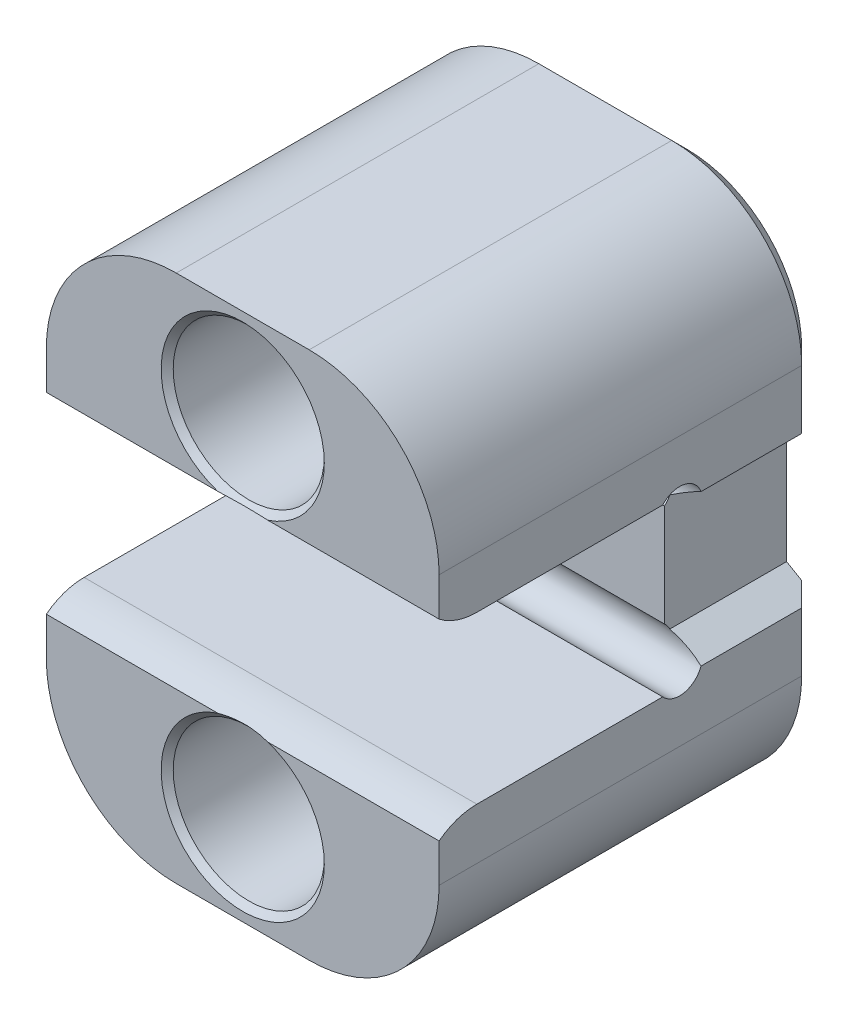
ISO-10303-21;
HEADER;
FILE_DESCRIPTION(('STEP AP214'),'2;1');
FILE_NAME('part.step','',(''),(''),'','','');
FILE_SCHEMA(('AUTOMOTIVE_DESIGN { 1 0 10303 214 1 1 1 1 }'));
ENDSEC;
DATA;
#1=APPLICATION_CONTEXT('core data for automotive mechanical design processes');
#2=APPLICATION_PROTOCOL_DEFINITION('international standard','automotive_design',2000,#1);
#3=PRODUCT_CONTEXT('',#1,'mechanical');
#4=PRODUCT('Part','Part','',(#3));
#5=PRODUCT_RELATED_PRODUCT_CATEGORY('part','',(#4));
#6=PRODUCT_DEFINITION_FORMATION('','',#4);
#7=PRODUCT_DEFINITION_CONTEXT('part definition',#1,'design');
#8=PRODUCT_DEFINITION('design','',#6,#7);
#9=PRODUCT_DEFINITION_SHAPE('','',#8);
#10=(LENGTH_UNIT() NAMED_UNIT(*) SI_UNIT(.MILLI.,.METRE.));
#11=(NAMED_UNIT(*) PLANE_ANGLE_UNIT() SI_UNIT($,.RADIAN.));
#12=(NAMED_UNIT(*) SI_UNIT($,.STERADIAN.) SOLID_ANGLE_UNIT());
#13=UNCERTAINTY_MEASURE_WITH_UNIT(LENGTH_MEASURE(1.E-05),#10,'distance_accuracy_value','');
#14=(GEOMETRIC_REPRESENTATION_CONTEXT(3) GLOBAL_UNCERTAINTY_ASSIGNED_CONTEXT((#13)) GLOBAL_UNIT_ASSIGNED_CONTEXT((#10,
#11,#12)) REPRESENTATION_CONTEXT('',''));
#15=CARTESIAN_POINT('',(0.,0.,0.));
#16=DIRECTION('',(0.,0.,1.));
#17=DIRECTION('',(1.,0.,0.));
#18=AXIS2_PLACEMENT_3D('',#15,#16,#17);
#19=CARTESIAN_POINT('',(13.,17.5,0.));
#20=DIRECTION('',(0.,0.,-1.));
#21=DIRECTION('',(0.,1.,0.));
#22=AXIS2_PLACEMENT_3D('',#19,#20,#21);
#23=PLANE('',#22);
#24=DIRECTION('',(1.,0.,0.));
#25=VECTOR('',#24,1.);
#26=CARTESIAN_POINT('',(-13.,6.35903533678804,0.));
#27=LINE('',#26,#25);
#28=CARTESIAN_POINT('',(-13.,6.35903533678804,0.));
#29=VERTEX_POINT('',#28);
#30=CARTESIAN_POINT('',(-1.65241711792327,6.35903533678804,0.));
#31=VERTEX_POINT('',#30);
#32=EDGE_CURVE('E531',#29,#31,#27,.T.);
#33=ORIENTED_EDGE('',*,*,#32,.T.);
#34=CARTESIAN_POINT('',(0.,11.5,0.));
#35=DIRECTION('',(0.,0.,-1.));
#36=DIRECTION('',(0.,1.,0.));
#37=AXIS2_PLACEMENT_3D('',#34,#35,#36);
#38=CIRCLE('',#37,5.4);
#39=CARTESIAN_POINT('',(1.65241711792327,6.35903533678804,0.));
#40=VERTEX_POINT('',#39);
#41=EDGE_CURVE('E46',#31,#40,#38,.T.);
#42=ORIENTED_EDGE('',*,*,#41,.T.);
#43=CARTESIAN_POINT('',(13.,6.35903533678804,0.));
#44=VERTEX_POINT('',#43);
#45=EDGE_CURVE('E530',#40,#44,#27,.T.);
#46=ORIENTED_EDGE('',*,*,#45,.T.);
#47=DIRECTION('',(0.,-1.,0.));
#48=VECTOR('',#47,1.);
#49=CARTESIAN_POINT('',(13.,17.5,0.));
#50=LINE('',#49,#48);
#51=CARTESIAN_POINT('',(13.,8.9,0.));
#52=VERTEX_POINT('',#51);
#53=EDGE_CURVE('E248',#52,#44,#50,.T.);
#54=ORIENTED_EDGE('',*,*,#53,.F.);
#55=CARTESIAN_POINT('',(4.4,8.9,0.));
#56=DIRECTION('',(0.,0.,-1.));
#57=DIRECTION('',(0.,1.,0.));
#58=AXIS2_PLACEMENT_3D('',#55,#56,#57);
#59=CIRCLE('',#58,8.6);
#60=CARTESIAN_POINT('',(4.4,17.5,0.));
#61=VERTEX_POINT('',#60);
#62=EDGE_CURVE('E278',#52,#61,#59,.F.);
#63=ORIENTED_EDGE('',*,*,#62,.T.);
#64=DIRECTION('',(-1.,0.,0.));
#65=VECTOR('',#64,1.);
#66=CARTESIAN_POINT('',(13.,17.5,0.));
#67=LINE('',#66,#65);
#68=CARTESIAN_POINT('',(-4.39999999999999,17.5,0.));
#69=VERTEX_POINT('',#68);
#70=EDGE_CURVE('E245',#61,#69,#67,.T.);
#71=ORIENTED_EDGE('',*,*,#70,.T.);
#72=CARTESIAN_POINT('',(-4.4,8.9,0.));
#73=DIRECTION('',(0.,0.,-1.));
#74=DIRECTION('',(0.,1.,0.));
#75=AXIS2_PLACEMENT_3D('',#72,#73,#74);
#76=CIRCLE('',#75,8.6);
#77=CARTESIAN_POINT('',(-13.,8.9,0.));
#78=VERTEX_POINT('',#77);
#79=EDGE_CURVE('E276',#69,#78,#76,.F.);
#80=ORIENTED_EDGE('',*,*,#79,.T.);
#81=DIRECTION('',(0.,-1.,0.));
#82=VECTOR('',#81,1.);
#83=CARTESIAN_POINT('',(-13.,17.5,0.));
#84=LINE('',#83,#82);
#85=EDGE_CURVE('E252',#78,#29,#84,.T.);
#86=ORIENTED_EDGE('',*,*,#85,.T.);
#87=EDGE_LOOP('',(#33,#42,#46,#54,#63,#71,#80,#86));
#88=FACE_BOUND('',#87,.T.);
#89=ADVANCED_FACE('F33',(#88),#23,.F.);
#90=CARTESIAN_POINT('',(13.,-5.5,0.));
#91=DIRECTION('',(-1.,0.,0.));
#92=DIRECTION('',(0.,0.,1.));
#93=AXIS2_PLACEMENT_3D('',#90,#91,#92);
#94=PLANE('',#93);
#95=DIRECTION('',(0.,0.,1.));
#96=VECTOR('',#95,1.);
#97=CARTESIAN_POINT('',(13.,5.,-25.));
#98=LINE('',#97,#96);
#99=CARTESIAN_POINT('',(13.,5.,-24.));
#100=VERTEX_POINT('',#99);
#101=CARTESIAN_POINT('',(13.,5.,-17.3342135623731));
#102=VERTEX_POINT('',#101);
#103=EDGE_CURVE('E505',#100,#102,#98,.T.);
#104=ORIENTED_EDGE('',*,*,#103,.F.);
#105=DIRECTION('',(0.,1.,0.));
#106=VECTOR('',#105,1.);
#107=CARTESIAN_POINT('',(13.,-5.5,-24.));
#108=LINE('',#107,#106);
#109=CARTESIAN_POINT('',(13.,8.9,-24.));
#110=VERTEX_POINT('',#109);
#111=EDGE_CURVE('E327',#100,#110,#108,.T.);
#112=ORIENTED_EDGE('',*,*,#111,.T.);
#113=DIRECTION('',(0.,0.,1.));
#114=VECTOR('',#113,1.);
#115=CARTESIAN_POINT('',(13.,8.9,0.));
#116=LINE('',#115,#114);
#117=EDGE_CURVE('E274',#110,#52,#116,.T.);
#118=ORIENTED_EDGE('',*,*,#117,.T.);
#119=ORIENTED_EDGE('',*,*,#53,.T.);
#120=CARTESIAN_POINT('',(13.,9.5673182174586,-2.49999968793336));
#121=DIRECTION('',(-1.,0.,0.));
#122=DIRECTION('',(0.,0.,-1.));
#123=AXIS2_PLACEMENT_3D('',#120,#121,#122);
#124=CIRCLE('',#123,4.06731821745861);
#125=CARTESIAN_POINT('',(13.,5.5,-2.49999999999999));
#126=VERTEX_POINT('',#125);
#127=EDGE_CURVE('E526',#126,#44,#124,.T.);
#128=ORIENTED_EDGE('',*,*,#127,.F.);
#129=DIRECTION('',(0.,0.,-1.));
#130=VECTOR('',#129,1.);
#131=CARTESIAN_POINT('',(13.,5.5,0.));
#132=LINE('',#131,#130);
#133=CARTESIAN_POINT('',(13.,5.5,-14.8019660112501));
#134=VERTEX_POINT('',#133);
#135=EDGE_CURVE('E243',#126,#134,#132,.T.);
#136=ORIENTED_EDGE('',*,*,#135,.T.);
#137=CARTESIAN_POINT('',(13.,4.5,-15.92));
#138=DIRECTION('',(1.,0.,0.));
#139=DIRECTION('',(0.,0.,-1.));
#140=AXIS2_PLACEMENT_3D('',#137,#138,#139);
#141=CIRCLE('',#140,1.5);
#142=EDGE_CURVE('E224',#102,#134,#141,.T.);
#143=ORIENTED_EDGE('',*,*,#142,.F.);
#144=EDGE_LOOP('',(#104,#112,#118,#119,#128,#136,#143));
#145=FACE_BOUND('',#144,.T.);
#146=ADVANCED_FACE('F411',(#145),#94,.F.);
#147=CARTESIAN_POINT('',(13.,5.5,0.));
#148=DIRECTION('',(0.,1.,0.));
#149=DIRECTION('',(0.,0.,1.));
#150=AXIS2_PLACEMENT_3D('',#147,#148,#149);
#151=PLANE('',#150);
#152=DIRECTION('',(0.,0.,-1.));
#153=VECTOR('',#152,1.);
#154=CARTESIAN_POINT('',(-13.,5.5,0.));
#155=LINE('',#154,#153);
#156=CARTESIAN_POINT('',(-13.,5.5,-2.49999999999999));
#157=VERTEX_POINT('',#156);
#158=CARTESIAN_POINT('',(-13.,5.5,-14.8019660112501));
#159=VERTEX_POINT('',#158);
#160=EDGE_CURVE('E255',#157,#159,#155,.T.);
#161=ORIENTED_EDGE('',*,*,#160,.T.);
#162=DIRECTION('',(1.,0.,0.));
#163=VECTOR('',#162,1.);
#164=CARTESIAN_POINT('',(-13.,5.5,-14.8019660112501));
#165=LINE('',#164,#163);
#166=EDGE_CURVE('E536',#159,#134,#165,.T.);
#167=ORIENTED_EDGE('',*,*,#166,.T.);
#168=ORIENTED_EDGE('',*,*,#135,.F.);
#169=DIRECTION('',(1.,0.,0.));
#170=VECTOR('',#169,1.);
#171=CARTESIAN_POINT('',(-13.,5.5,-2.49999999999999));
#172=LINE('',#171,#170);
#173=EDGE_CURVE('E535',#157,#126,#172,.T.);
#174=ORIENTED_EDGE('',*,*,#173,.F.);
#175=EDGE_LOOP('',(#161,#167,#168,#174));
#176=FACE_BOUND('',#175,.T.);
#177=ADVANCED_FACE('F436',(#176),#151,.F.);
#178=CARTESIAN_POINT('',(13.,5.5,-16.92));
#179=DIRECTION('',(0.,0.,-1.));
#180=DIRECTION('',(-1.,0.,0.));
#181=AXIS2_PLACEMENT_3D('',#178,#179,#180);
#182=PLANE('',#181);
#183=DIRECTION('',(0.,-1.,0.));
#184=VECTOR('',#183,1.);
#185=CARTESIAN_POINT('',(-13.,5.5,-16.92));
#186=LINE('',#185,#184);
#187=CARTESIAN_POINT('',(-13.,3.3819660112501,-16.92));
#188=VERTEX_POINT('',#187);
#189=CARTESIAN_POINT('',(-13.,-3.3819660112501,-16.92));
#190=VERTEX_POINT('',#189);
#191=EDGE_CURVE('E259',#188,#190,#186,.T.);
#192=ORIENTED_EDGE('',*,*,#191,.T.);
#193=DIRECTION('',(1.,0.,0.));
#194=VECTOR('',#193,1.);
#195=CARTESIAN_POINT('',(-13.,-3.38196601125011,-16.92));
#196=LINE('',#195,#194);
#197=CARTESIAN_POINT('',(11.,-3.3819660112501,-16.92));
#198=VERTEX_POINT('',#197);
#199=EDGE_CURVE('E225',#190,#198,#196,.T.);
#200=ORIENTED_EDGE('',*,*,#199,.T.);
#201=DIRECTION('',(0.,1.,0.));
#202=VECTOR('',#201,1.);
#203=CARTESIAN_POINT('',(11.,5.5,-16.92));
#204=LINE('',#203,#202);
#205=CARTESIAN_POINT('',(11.,3.3819660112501,-16.92));
#206=VERTEX_POINT('',#205);
#207=EDGE_CURVE('E256',#198,#206,#204,.T.);
#208=ORIENTED_EDGE('',*,*,#207,.T.);
#209=DIRECTION('',(1.,0.,0.));
#210=VECTOR('',#209,1.);
#211=CARTESIAN_POINT('',(-13.,3.38196601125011,-16.92));
#212=LINE('',#211,#210);
#213=EDGE_CURVE('E541',#206,#188,#212,.F.);
#214=ORIENTED_EDGE('',*,*,#213,.T.);
#215=EDGE_LOOP('',(#192,#200,#208,#214));
#216=FACE_BOUND('',#215,.T.);
#217=ADVANCED_FACE('F433',(#216),#182,.F.);
#218=CARTESIAN_POINT('',(13.,-5.5,-16.92));
#219=DIRECTION('',(0.,-1.,0.));
#220=DIRECTION('',(0.,0.,-1.));
#221=AXIS2_PLACEMENT_3D('',#218,#219,#220);
#222=PLANE('',#221);
#223=DIRECTION('',(0.,0.,1.));
#224=VECTOR('',#223,1.);
#225=CARTESIAN_POINT('',(13.,-5.5,-16.92));
#226=LINE('',#225,#224);
#227=CARTESIAN_POINT('',(13.,-5.5,-14.8019660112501));
#228=VERTEX_POINT('',#227);
#229=CARTESIAN_POINT('',(13.,-5.5,-2.49999999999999));
#230=VERTEX_POINT('',#229);
#231=EDGE_CURVE('E231',#228,#230,#226,.T.);
#232=ORIENTED_EDGE('',*,*,#231,.F.);
#233=DIRECTION('',(1.,0.,0.));
#234=VECTOR('',#233,1.);
#235=CARTESIAN_POINT('',(-13.,-5.5,-14.8019660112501));
#236=LINE('',#235,#234);
#237=CARTESIAN_POINT('',(-13.,-5.5,-14.8019660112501));
#238=VERTEX_POINT('',#237);
#239=EDGE_CURVE('E214',#228,#238,#236,.F.);
#240=ORIENTED_EDGE('',*,*,#239,.T.);
#241=DIRECTION('',(0.,0.,1.));
#242=VECTOR('',#241,1.);
#243=CARTESIAN_POINT('',(-13.,-5.5,-16.92));
#244=LINE('',#243,#242);
#245=CARTESIAN_POINT('',(-13.,-5.5,-2.49999999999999));
#246=VERTEX_POINT('',#245);
#247=EDGE_CURVE('E262',#238,#246,#244,.T.);
#248=ORIENTED_EDGE('',*,*,#247,.T.);
#249=DIRECTION('',(1.,0.,0.));
#250=VECTOR('',#249,1.);
#251=CARTESIAN_POINT('',(-13.,-5.5,-2.49999999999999));
#252=LINE('',#251,#250);
#253=EDGE_CURVE('E241',#246,#230,#252,.T.);
#254=ORIENTED_EDGE('',*,*,#253,.T.);
#255=EDGE_LOOP('',(#232,#240,#248,#254));
#256=FACE_BOUND('',#255,.T.);
#257=ADVANCED_FACE('F239',(#256),#222,.F.);
#258=CARTESIAN_POINT('',(13.,-5.5,0.));
#259=DIRECTION('',(0.,0.,-1.));
#260=DIRECTION('',(0.,1.,0.));
#261=AXIS2_PLACEMENT_3D('',#258,#259,#260);
#262=PLANE('',#261);
#263=DIRECTION('',(1.,0.,0.));
#264=VECTOR('',#263,1.);
#265=CARTESIAN_POINT('',(-13.,-6.35903533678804,0.));
#266=LINE('',#265,#264);
#267=CARTESIAN_POINT('',(1.65241711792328,-6.35903533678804,0.));
#268=VERTEX_POINT('',#267);
#269=CARTESIAN_POINT('',(13.,-6.35903533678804,0.));
#270=VERTEX_POINT('',#269);
#271=EDGE_CURVE('E554',#268,#270,#266,.T.);
#272=ORIENTED_EDGE('',*,*,#271,.F.);
#273=CARTESIAN_POINT('',(0.,-11.5,0.));
#274=DIRECTION('',(0.,0.,-1.));
#275=DIRECTION('',(0.,1.,0.));
#276=AXIS2_PLACEMENT_3D('',#273,#274,#275);
#277=CIRCLE('',#276,5.4);
#278=CARTESIAN_POINT('',(-1.65241711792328,-6.35903533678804,0.));
#279=VERTEX_POINT('',#278);
#280=EDGE_CURVE('E373',#268,#279,#277,.T.);
#281=ORIENTED_EDGE('',*,*,#280,.T.);
#282=CARTESIAN_POINT('',(-13.,-6.35903533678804,0.));
#283=VERTEX_POINT('',#282);
#284=EDGE_CURVE('E550',#283,#279,#266,.T.);
#285=ORIENTED_EDGE('',*,*,#284,.F.);
#286=DIRECTION('',(0.,-1.,0.));
#287=VECTOR('',#286,1.);
#288=CARTESIAN_POINT('',(-13.,-5.5,0.));
#289=LINE('',#288,#287);
#290=CARTESIAN_POINT('',(-13.,-8.9,0.));
#291=VERTEX_POINT('',#290);
#292=EDGE_CURVE('E264',#283,#291,#289,.T.);
#293=ORIENTED_EDGE('',*,*,#292,.T.);
#294=CARTESIAN_POINT('',(-4.4,-8.9,0.));
#295=DIRECTION('',(0.,0.,-1.));
#296=DIRECTION('',(0.,1.,0.));
#297=AXIS2_PLACEMENT_3D('',#294,#295,#296);
#298=CIRCLE('',#297,8.6);
#299=CARTESIAN_POINT('',(-4.39999999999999,-17.5,0.));
#300=VERTEX_POINT('',#299);
#301=EDGE_CURVE('E290',#291,#300,#298,.F.);
#302=ORIENTED_EDGE('',*,*,#301,.T.);
#303=DIRECTION('',(-1.,0.,0.));
#304=VECTOR('',#303,1.);
#305=CARTESIAN_POINT('',(13.,-17.5,0.));
#306=LINE('',#305,#304);
#307=CARTESIAN_POINT('',(4.4,-17.5,0.));
#308=VERTEX_POINT('',#307);
#309=EDGE_CURVE('E269',#308,#300,#306,.T.);
#310=ORIENTED_EDGE('',*,*,#309,.F.);
#311=CARTESIAN_POINT('',(4.4,-8.9,0.));
#312=DIRECTION('',(0.,0.,-1.));
#313=DIRECTION('',(0.,1.,0.));
#314=AXIS2_PLACEMENT_3D('',#311,#312,#313);
#315=CIRCLE('',#314,8.6);
#316=CARTESIAN_POINT('',(13.,-8.9,0.));
#317=VERTEX_POINT('',#316);
#318=EDGE_CURVE('E292',#308,#317,#315,.F.);
#319=ORIENTED_EDGE('',*,*,#318,.T.);
#320=DIRECTION('',(0.,-1.,0.));
#321=VECTOR('',#320,1.);
#322=CARTESIAN_POINT('',(13.,-5.5,0.));
#323=LINE('',#322,#321);
#324=EDGE_CURVE('E242',#270,#317,#323,.T.);
#325=ORIENTED_EDGE('',*,*,#324,.F.);
#326=EDGE_LOOP('',(#272,#281,#285,#293,#302,#310,#319,#325));
#327=FACE_BOUND('',#326,.T.);
#328=ADVANCED_FACE('F426',(#327),#262,.F.);
#329=CARTESIAN_POINT('',(13.,-17.5,0.));
#330=DIRECTION('',(0.,1.,0.));
#331=DIRECTION('',(0.,0.,1.));
#332=AXIS2_PLACEMENT_3D('',#329,#330,#331);
#333=PLANE('',#332);
#334=DIRECTION('',(0.,0.,-1.));
#335=VECTOR('',#334,1.);
#336=CARTESIAN_POINT('',(-4.4,-17.5,-25.));
#337=LINE('',#336,#335);
#338=CARTESIAN_POINT('',(-4.4,-17.5,-24.));
#339=VERTEX_POINT('',#338);
#340=EDGE_CURVE('E285',#300,#339,#337,.T.);
#341=ORIENTED_EDGE('',*,*,#340,.T.);
#342=DIRECTION('',(1.,0.,0.));
#343=VECTOR('',#342,1.);
#344=CARTESIAN_POINT('',(13.,-17.5,-24.));
#345=LINE('',#344,#343);
#346=CARTESIAN_POINT('',(4.4,-17.5,-24.));
#347=VERTEX_POINT('',#346);
#348=EDGE_CURVE('E335',#339,#347,#345,.T.);
#349=ORIENTED_EDGE('',*,*,#348,.T.);
#350=DIRECTION('',(0.,0.,-1.));
#351=VECTOR('',#350,1.);
#352=CARTESIAN_POINT('',(4.4,-17.5,0.));
#353=LINE('',#352,#351);
#354=EDGE_CURVE('E288',#347,#308,#353,.F.);
#355=ORIENTED_EDGE('',*,*,#354,.T.);
#356=ORIENTED_EDGE('',*,*,#309,.T.);
#357=EDGE_LOOP('',(#341,#349,#355,#356));
#358=FACE_BOUND('',#357,.T.);
#359=ADVANCED_FACE('F422',(#358),#333,.F.);
#360=CARTESIAN_POINT('',(13.,17.5,-25.));
#361=DIRECTION('',(0.,0.,1.));
#362=DIRECTION('',(1.,0.,0.));
#363=AXIS2_PLACEMENT_3D('',#360,#361,#362);
#364=PLANE('',#363);
#365=DIRECTION('',(0.866025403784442,-0.499999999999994,0.));
#366=VECTOR('',#365,1.);
#367=CARTESIAN_POINT('',(11.,-3.84529946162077,-25.));
#368=LINE('',#367,#366);
#369=CARTESIAN_POINT('',(11.,-3.84529946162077,-25.));
#370=VERTEX_POINT('',#369);
#371=CARTESIAN_POINT('',(12.,-4.42264973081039,-25.));
#372=VERTEX_POINT('',#371);
#373=EDGE_CURVE('E558',#370,#372,#368,.T.);
#374=ORIENTED_EDGE('',*,*,#373,.T.);
#375=DIRECTION('',(0.,-1.,0.));
#376=VECTOR('',#375,1.);
#377=CARTESIAN_POINT('',(12.,17.5,-25.));
#378=LINE('',#377,#376);
#379=CARTESIAN_POINT('',(12.,-8.9,-25.));
#380=VERTEX_POINT('',#379);
#381=EDGE_CURVE('E325',#372,#380,#378,.T.);
#382=ORIENTED_EDGE('',*,*,#381,.T.);
#383=CARTESIAN_POINT('',(4.4,-8.9,-25.));
#384=DIRECTION('',(0.,0.,1.));
#385=DIRECTION('',(1.,0.,0.));
#386=AXIS2_PLACEMENT_3D('',#383,#384,#385);
#387=CIRCLE('',#386,7.6);
#388=CARTESIAN_POINT('',(4.4,-16.5,-25.));
#389=VERTEX_POINT('',#388);
#390=EDGE_CURVE('E321',#380,#389,#387,.F.);
#391=ORIENTED_EDGE('',*,*,#390,.T.);
#392=DIRECTION('',(-1.,0.,0.));
#393=VECTOR('',#392,1.);
#394=CARTESIAN_POINT('',(13.,-16.5,-25.));
#395=LINE('',#394,#393);
#396=CARTESIAN_POINT('',(-4.4,-16.5,-25.));
#397=VERTEX_POINT('',#396);
#398=EDGE_CURVE('E317',#389,#397,#395,.T.);
#399=ORIENTED_EDGE('',*,*,#398,.T.);
#400=CARTESIAN_POINT('',(-4.4,-8.9,-25.));
#401=DIRECTION('',(0.,0.,1.));
#402=DIRECTION('',(1.,0.,0.));
#403=AXIS2_PLACEMENT_3D('',#400,#401,#402);
#404=CIRCLE('',#403,7.6);
#405=CARTESIAN_POINT('',(-12.,-8.9,-25.));
#406=VERTEX_POINT('',#405);
#407=EDGE_CURVE('E315',#397,#406,#404,.F.);
#408=ORIENTED_EDGE('',*,*,#407,.T.);
#409=DIRECTION('',(0.,1.,0.));
#410=VECTOR('',#409,1.);
#411=CARTESIAN_POINT('',(-12.,8.9,-25.));
#412=LINE('',#411,#410);
#413=CARTESIAN_POINT('',(-12.,8.9,-25.));
#414=VERTEX_POINT('',#413);
#415=EDGE_CURVE('E311',#406,#414,#412,.T.);
#416=ORIENTED_EDGE('',*,*,#415,.T.);
#417=CARTESIAN_POINT('',(-4.4,8.9,-25.));
#418=DIRECTION('',(0.,0.,1.));
#419=DIRECTION('',(1.,0.,0.));
#420=AXIS2_PLACEMENT_3D('',#417,#418,#419);
#421=CIRCLE('',#420,7.6);
#422=CARTESIAN_POINT('',(-4.4,16.5,-25.));
#423=VERTEX_POINT('',#422);
#424=EDGE_CURVE('E309',#414,#423,#421,.F.);
#425=ORIENTED_EDGE('',*,*,#424,.T.);
#426=DIRECTION('',(1.,0.,0.));
#427=VECTOR('',#426,1.);
#428=CARTESIAN_POINT('',(13.,16.5,-25.));
#429=LINE('',#428,#427);
#430=CARTESIAN_POINT('',(4.4,16.5,-25.));
#431=VERTEX_POINT('',#430);
#432=EDGE_CURVE('E313',#423,#431,#429,.T.);
#433=ORIENTED_EDGE('',*,*,#432,.T.);
#434=CARTESIAN_POINT('',(4.4,8.9,-25.));
#435=DIRECTION('',(0.,0.,1.));
#436=DIRECTION('',(1.,0.,0.));
#437=AXIS2_PLACEMENT_3D('',#434,#435,#436);
#438=CIRCLE('',#437,7.6);
#439=CARTESIAN_POINT('',(12.,8.9,-25.));
#440=VERTEX_POINT('',#439);
#441=EDGE_CURVE('E319',#431,#440,#438,.F.);
#442=ORIENTED_EDGE('',*,*,#441,.T.);
#443=DIRECTION('',(0.,-1.,0.));
#444=VECTOR('',#443,1.);
#445=CARTESIAN_POINT('',(12.,17.5,-25.));
#446=LINE('',#445,#444);
#447=CARTESIAN_POINT('',(12.,4.42264973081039,-25.));
#448=VERTEX_POINT('',#447);
#449=EDGE_CURVE('E323',#440,#448,#446,.T.);
#450=ORIENTED_EDGE('',*,*,#449,.T.);
#451=DIRECTION('',(-0.866025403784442,-0.499999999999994,0.));
#452=VECTOR('',#451,1.);
#453=CARTESIAN_POINT('',(11.,3.84529946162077,-25.));
#454=LINE('',#453,#452);
#455=CARTESIAN_POINT('',(11.,3.84529946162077,-25.));
#456=VERTEX_POINT('',#455);
#457=EDGE_CURVE('E508',#448,#456,#454,.T.);
#458=ORIENTED_EDGE('',*,*,#457,.T.);
#459=DIRECTION('',(0.,-1.,0.));
#460=VECTOR('',#459,1.);
#461=CARTESIAN_POINT('',(11.,-3.84529946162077,-25.));
#462=LINE('',#461,#460);
#463=EDGE_CURVE('E553',#456,#370,#462,.T.);
#464=ORIENTED_EDGE('',*,*,#463,.T.);
#465=EDGE_LOOP('',(#374,#382,#391,#399,#408,#416,#425,#433,#442,#450,#458,#464));
#466=FACE_BOUND('',#465,.T.);
#467=CARTESIAN_POINT('',(0.,11.5,-25.));
#468=DIRECTION('',(0.,0.,1.));
#469=DIRECTION('',(1.,0.,0.));
#470=AXIS2_PLACEMENT_3D('',#467,#468,#469);
#471=CIRCLE('',#470,2.89999999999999);
#472=CARTESIAN_POINT('',(2.89999999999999,11.5,-25.));
#473=VERTEX_POINT('',#472);
#474=EDGE_CURVE('E621',#473,#473,#471,.T.);
#475=ORIENTED_EDGE('',*,*,#474,.T.);
#476=EDGE_LOOP('',(#475));
#477=FACE_BOUND('',#476,.T.);
#478=CARTESIAN_POINT('',(0.,-11.5,-25.));
#479=DIRECTION('',(0.,0.,1.));
#480=DIRECTION('',(1.,0.,0.));
#481=AXIS2_PLACEMENT_3D('',#478,#479,#480);
#482=CIRCLE('',#481,2.89999999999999);
#483=CARTESIAN_POINT('',(2.89999999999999,-11.5,-25.));
#484=VERTEX_POINT('',#483);
#485=EDGE_CURVE('E236',#484,#484,#482,.T.);
#486=ORIENTED_EDGE('',*,*,#485,.T.);
#487=EDGE_LOOP('',(#486));
#488=FACE_BOUND('',#487,.T.);
#489=ADVANCED_FACE('F418',(#466,#477,#488),#364,.F.);
#490=CARTESIAN_POINT('',(13.,17.5,0.));
#491=DIRECTION('',(0.,-1.,0.));
#492=DIRECTION('',(0.,0.,-1.));
#493=AXIS2_PLACEMENT_3D('',#490,#491,#492);
#494=PLANE('',#493);
#495=DIRECTION('',(0.,0.,1.));
#496=VECTOR('',#495,1.);
#497=CARTESIAN_POINT('',(4.4,17.5,0.));
#498=LINE('',#497,#496);
#499=CARTESIAN_POINT('',(4.4,17.5,-24.));
#500=VERTEX_POINT('',#499);
#501=EDGE_CURVE('E282',#61,#500,#498,.F.);
#502=ORIENTED_EDGE('',*,*,#501,.T.);
#503=DIRECTION('',(-1.,0.,0.));
#504=VECTOR('',#503,1.);
#505=CARTESIAN_POINT('',(13.,17.5,-24.));
#506=LINE('',#505,#504);
#507=CARTESIAN_POINT('',(-4.4,17.5,-24.));
#508=VERTEX_POINT('',#507);
#509=EDGE_CURVE('E339',#500,#508,#506,.T.);
#510=ORIENTED_EDGE('',*,*,#509,.T.);
#511=DIRECTION('',(0.,0.,1.));
#512=VECTOR('',#511,1.);
#513=CARTESIAN_POINT('',(-4.4,17.5,0.));
#514=LINE('',#513,#512);
#515=EDGE_CURVE('E280',#508,#69,#514,.T.);
#516=ORIENTED_EDGE('',*,*,#515,.T.);
#517=ORIENTED_EDGE('',*,*,#70,.F.);
#518=EDGE_LOOP('',(#502,#510,#516,#517));
#519=FACE_BOUND('',#518,.T.);
#520=ADVANCED_FACE('F410',(#519),#494,.F.);
#521=DIRECTION('',(0.,0.,-1.));
#522=VECTOR('',#521,1.);
#523=CARTESIAN_POINT('',(13.,-8.9,0.));
#524=LINE('',#523,#522);
#525=CARTESIAN_POINT('',(13.,-8.9,-24.));
#526=VERTEX_POINT('',#525);
#527=EDGE_CURVE('E272',#317,#526,#524,.T.);
#528=ORIENTED_EDGE('',*,*,#527,.T.);
#529=DIRECTION('',(0.,1.,0.));
#530=VECTOR('',#529,1.);
#531=CARTESIAN_POINT('',(13.,-5.5,-24.));
#532=LINE('',#531,#530);
#533=CARTESIAN_POINT('',(13.,-5.,-24.));
#534=VERTEX_POINT('',#533);
#535=EDGE_CURVE('E305',#526,#534,#532,.T.);
#536=ORIENTED_EDGE('',*,*,#535,.T.);
#537=DIRECTION('',(0.,0.,1.));
#538=VECTOR('',#537,1.);
#539=CARTESIAN_POINT('',(13.,-5.,-25.));
#540=LINE('',#539,#538);
#541=CARTESIAN_POINT('',(13.,-5.,-17.3342135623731));
#542=VERTEX_POINT('',#541);
#543=EDGE_CURVE('E235',#534,#542,#540,.T.);
#544=ORIENTED_EDGE('',*,*,#543,.T.);
#545=CARTESIAN_POINT('',(13.,-4.5,-15.92));
#546=DIRECTION('',(1.,0.,0.));
#547=DIRECTION('',(0.,0.,1.));
#548=AXIS2_PLACEMENT_3D('',#545,#546,#547);
#549=CIRCLE('',#548,1.5);
#550=EDGE_CURVE('E217',#228,#542,#549,.T.);
#551=ORIENTED_EDGE('',*,*,#550,.F.);
#552=ORIENTED_EDGE('',*,*,#231,.T.);
#553=CARTESIAN_POINT('',(13.,-9.5673182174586,-2.49999968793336));
#554=DIRECTION('',(-1.,0.,0.));
#555=DIRECTION('',(0.,0.,1.));
#556=AXIS2_PLACEMENT_3D('',#553,#554,#555);
#557=CIRCLE('',#556,4.06731821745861);
#558=EDGE_CURVE('E544',#270,#230,#557,.T.);
#559=ORIENTED_EDGE('',*,*,#558,.F.);
#560=ORIENTED_EDGE('',*,*,#324,.T.);
#561=EDGE_LOOP('',(#528,#536,#544,#551,#552,#559,#560));
#562=FACE_BOUND('',#561,.T.);
#563=ADVANCED_FACE('F229',(#562),#94,.F.);
#564=CARTESIAN_POINT('',(-13.,-5.5,0.));
#565=DIRECTION('',(-1.,0.,0.));
#566=DIRECTION('',(0.,0.,1.));
#567=AXIS2_PLACEMENT_3D('',#564,#565,#566);
#568=PLANE('',#567);
#569=DIRECTION('',(0.,0.,1.));
#570=VECTOR('',#569,1.);
#571=CARTESIAN_POINT('',(-13.,8.9,-25.));
#572=LINE('',#571,#570);
#573=CARTESIAN_POINT('',(-13.,8.9,-24.));
#574=VERTEX_POINT('',#573);
#575=EDGE_CURVE('E295',#78,#574,#572,.F.);
#576=ORIENTED_EDGE('',*,*,#575,.T.);
#577=DIRECTION('',(0.,-1.,0.));
#578=VECTOR('',#577,1.);
#579=CARTESIAN_POINT('',(-13.,-8.90000000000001,-24.));
#580=LINE('',#579,#578);
#581=CARTESIAN_POINT('',(-13.,-8.9,-24.));
#582=VERTEX_POINT('',#581);
#583=EDGE_CURVE('E341',#574,#582,#580,.T.);
#584=ORIENTED_EDGE('',*,*,#583,.T.);
#585=DIRECTION('',(0.,0.,-1.));
#586=VECTOR('',#585,1.);
#587=CARTESIAN_POINT('',(-13.,-8.9,0.));
#588=LINE('',#587,#586);
#589=EDGE_CURVE('E298',#582,#291,#588,.F.);
#590=ORIENTED_EDGE('',*,*,#589,.T.);
#591=ORIENTED_EDGE('',*,*,#292,.F.);
#592=CARTESIAN_POINT('',(-13.,-9.5673182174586,-2.49999968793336));
#593=DIRECTION('',(-1.,0.,0.));
#594=DIRECTION('',(0.,0.,1.));
#595=AXIS2_PLACEMENT_3D('',#592,#593,#594);
#596=CIRCLE('',#595,4.06731821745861);
#597=EDGE_CURVE('E546',#283,#246,#596,.T.);
#598=ORIENTED_EDGE('',*,*,#597,.T.);
#599=ORIENTED_EDGE('',*,*,#247,.F.);
#600=CARTESIAN_POINT('',(-13.,-4.5,-15.92));
#601=DIRECTION('',(1.,0.,0.));
#602=DIRECTION('',(0.,0.,1.));
#603=AXIS2_PLACEMENT_3D('',#600,#601,#602);
#604=CIRCLE('',#603,1.5);
#605=EDGE_CURVE('E220',#238,#190,#604,.T.);
#606=ORIENTED_EDGE('',*,*,#605,.T.);
#607=ORIENTED_EDGE('',*,*,#191,.F.);
#608=CARTESIAN_POINT('',(-13.,4.5,-15.92));
#609=DIRECTION('',(1.,0.,0.));
#610=DIRECTION('',(0.,0.,-1.));
#611=AXIS2_PLACEMENT_3D('',#608,#609,#610);
#612=CIRCLE('',#611,1.5);
#613=EDGE_CURVE('E600',#188,#159,#612,.T.);
#614=ORIENTED_EDGE('',*,*,#613,.T.);
#615=ORIENTED_EDGE('',*,*,#160,.F.);
#616=CARTESIAN_POINT('',(-13.,9.5673182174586,-2.49999968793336));
#617=DIRECTION('',(-1.,0.,0.));
#618=DIRECTION('',(0.,0.,-1.));
#619=AXIS2_PLACEMENT_3D('',#616,#617,#618);
#620=CIRCLE('',#619,4.06731821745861);
#621=EDGE_CURVE('E532',#157,#29,#620,.T.);
#622=ORIENTED_EDGE('',*,*,#621,.T.);
#623=ORIENTED_EDGE('',*,*,#85,.F.);
#624=EDGE_LOOP('',(#576,#584,#590,#591,#598,#599,#606,#607,#614,#615,#622,#623));
#625=FACE_BOUND('',#624,.T.);
#626=ADVANCED_FACE('F409',(#625),#568,.T.);
#627=CARTESIAN_POINT('',(4.4,8.9,0.));
#628=DIRECTION('',(0.,0.,1.));
#629=DIRECTION('',(1.,0.,0.));
#630=AXIS2_PLACEMENT_3D('',#627,#628,#629);
#631=CYLINDRICAL_SURFACE('',#630,8.6);
#632=ORIENTED_EDGE('',*,*,#117,.F.);
#633=CARTESIAN_POINT('',(4.4,8.9,-24.));
#634=DIRECTION('',(0.,0.,1.));
#635=DIRECTION('',(1.,0.,0.));
#636=AXIS2_PLACEMENT_3D('',#633,#634,#635);
#637=CIRCLE('',#636,8.6);
#638=EDGE_CURVE('E333',#110,#500,#637,.T.);
#639=ORIENTED_EDGE('',*,*,#638,.T.);
#640=ORIENTED_EDGE('',*,*,#501,.F.);
#641=ORIENTED_EDGE('',*,*,#62,.F.);
#642=EDGE_LOOP('',(#632,#639,#640,#641));
#643=FACE_BOUND('',#642,.T.);
#644=ADVANCED_FACE('F414',(#643),#631,.T.);
#645=CARTESIAN_POINT('',(4.4,-8.9,0.));
#646=DIRECTION('',(0.,0.,-1.));
#647=DIRECTION('',(-1.,0.,0.));
#648=AXIS2_PLACEMENT_3D('',#645,#646,#647);
#649=CYLINDRICAL_SURFACE('',#648,8.6);
#650=ORIENTED_EDGE('',*,*,#354,.F.);
#651=CARTESIAN_POINT('',(4.4,-8.9,-24.));
#652=DIRECTION('',(0.,0.,1.));
#653=DIRECTION('',(1.,0.,0.));
#654=AXIS2_PLACEMENT_3D('',#651,#652,#653);
#655=CIRCLE('',#654,8.6);
#656=EDGE_CURVE('E331',#347,#526,#655,.T.);
#657=ORIENTED_EDGE('',*,*,#656,.T.);
#658=ORIENTED_EDGE('',*,*,#527,.F.);
#659=ORIENTED_EDGE('',*,*,#318,.F.);
#660=EDGE_LOOP('',(#650,#657,#658,#659));
#661=FACE_BOUND('',#660,.T.);
#662=ADVANCED_FACE('F446',(#661),#649,.T.);
#663=CARTESIAN_POINT('',(-4.4,-8.9,0.));
#664=DIRECTION('',(0.,0.,1.));
#665=DIRECTION('',(1.,0.,0.));
#666=AXIS2_PLACEMENT_3D('',#663,#664,#665);
#667=CYLINDRICAL_SURFACE('',#666,8.6);
#668=ORIENTED_EDGE('',*,*,#589,.F.);
#669=CARTESIAN_POINT('',(-4.4,-8.9,-24.));
#670=DIRECTION('',(0.,0.,1.));
#671=DIRECTION('',(1.,0.,0.));
#672=AXIS2_PLACEMENT_3D('',#669,#670,#671);
#673=CIRCLE('',#672,8.6);
#674=EDGE_CURVE('E337',#582,#339,#673,.T.);
#675=ORIENTED_EDGE('',*,*,#674,.T.);
#676=ORIENTED_EDGE('',*,*,#340,.F.);
#677=ORIENTED_EDGE('',*,*,#301,.F.);
#678=EDGE_LOOP('',(#668,#675,#676,#677));
#679=FACE_BOUND('',#678,.T.);
#680=ADVANCED_FACE('F450',(#679),#667,.T.);
#681=CARTESIAN_POINT('',(-4.4,8.9,0.));
#682=DIRECTION('',(0.,0.,-1.));
#683=DIRECTION('',(-1.,0.,0.));
#684=AXIS2_PLACEMENT_3D('',#681,#682,#683);
#685=CYLINDRICAL_SURFACE('',#684,8.6);
#686=ORIENTED_EDGE('',*,*,#515,.F.);
#687=CARTESIAN_POINT('',(-4.4,8.9,-24.));
#688=DIRECTION('',(0.,0.,1.));
#689=DIRECTION('',(1.,0.,0.));
#690=AXIS2_PLACEMENT_3D('',#687,#688,#689);
#691=CIRCLE('',#690,8.6);
#692=EDGE_CURVE('E343',#508,#574,#691,.T.);
#693=ORIENTED_EDGE('',*,*,#692,.T.);
#694=ORIENTED_EDGE('',*,*,#575,.F.);
#695=ORIENTED_EDGE('',*,*,#79,.F.);
#696=EDGE_LOOP('',(#686,#693,#694,#695));
#697=FACE_BOUND('',#696,.T.);
#698=ADVANCED_FACE('F405',(#697),#685,.T.);
#699=CARTESIAN_POINT('',(11.,-3.84529946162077,-25.));
#700=DIRECTION('',(-1.,0.,0.));
#701=DIRECTION('',(0.,0.,1.));
#702=AXIS2_PLACEMENT_3D('',#699,#700,#701);
#703=PLANE('',#702);
#704=ORIENTED_EDGE('',*,*,#207,.F.);
#705=CARTESIAN_POINT('',(11.,-4.5,-15.92));
#706=DIRECTION('',(-1.,0.,0.));
#707=DIRECTION('',(0.,0.,1.));
#708=AXIS2_PLACEMENT_3D('',#705,#706,#707);
#709=CIRCLE('',#708,1.5);
#710=CARTESIAN_POINT('',(11.,-3.84529946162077,-17.2695803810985));
#711=VERTEX_POINT('',#710);
#712=EDGE_CURVE('E566',#198,#711,#709,.T.);
#713=ORIENTED_EDGE('',*,*,#712,.T.);
#714=DIRECTION('',(0.,0.,1.));
#715=VECTOR('',#714,1.);
#716=CARTESIAN_POINT('',(11.,-3.84529946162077,-25.));
#717=LINE('',#716,#715);
#718=EDGE_CURVE('E516',#370,#711,#717,.T.);
#719=ORIENTED_EDGE('',*,*,#718,.F.);
#720=ORIENTED_EDGE('',*,*,#463,.F.);
#721=DIRECTION('',(0.,0.,1.));
#722=VECTOR('',#721,1.);
#723=CARTESIAN_POINT('',(11.,3.84529946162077,-25.));
#724=LINE('',#723,#722);
#725=CARTESIAN_POINT('',(11.,3.84529946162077,-17.2695803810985));
#726=VERTEX_POINT('',#725);
#727=EDGE_CURVE('E512',#456,#726,#724,.T.);
#728=ORIENTED_EDGE('',*,*,#727,.T.);
#729=CARTESIAN_POINT('',(11.,4.5,-15.92));
#730=DIRECTION('',(-1.,0.,0.));
#731=DIRECTION('',(0.,0.,1.));
#732=AXIS2_PLACEMENT_3D('',#729,#730,#731);
#733=CIRCLE('',#732,1.5);
#734=EDGE_CURVE('E603',#726,#206,#733,.T.);
#735=ORIENTED_EDGE('',*,*,#734,.T.);
#736=EDGE_LOOP('',(#704,#713,#719,#720,#728,#735));
#737=FACE_BOUND('',#736,.T.);
#738=ADVANCED_FACE('F398',(#737),#703,.F.);
#739=CARTESIAN_POINT('',(11.,3.84529946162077,-25.));
#740=DIRECTION('',(-0.499999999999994,0.866025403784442,0.));
#741=DIRECTION('',(-0.866025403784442,-0.499999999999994,0.));
#742=AXIS2_PLACEMENT_3D('',#739,#740,#741);
#743=PLANE('',#742);
#744=ORIENTED_EDGE('',*,*,#457,.F.);
#745=DIRECTION('',(-0.654653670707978,-0.377964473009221,-0.65465367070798));
#746=VECTOR('',#745,1.);
#747=CARTESIAN_POINT('',(10.4019237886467,3.50000000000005,-26.5980762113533));
#748=LINE('',#747,#746);
#749=EDGE_CURVE('E329',#448,#100,#748,.F.);
#750=ORIENTED_EDGE('',*,*,#749,.T.);
#751=ORIENTED_EDGE('',*,*,#103,.T.);
#752=CARTESIAN_POINT('',(12.1339745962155,4.5,-15.92));
#753=DIRECTION('',(-0.499999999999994,0.866025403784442,0.));
#754=DIRECTION('',(0.866025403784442,0.499999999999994,0.));
#755=AXIS2_PLACEMENT_3D('',#752,#753,#754);
#756=ELLIPSE('',#755,3.00000000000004,1.5);
#757=EDGE_CURVE('E300',#102,#726,#756,.T.);
#758=ORIENTED_EDGE('',*,*,#757,.T.);
#759=ORIENTED_EDGE('',*,*,#727,.F.);
#760=EDGE_LOOP('',(#744,#750,#751,#758,#759));
#761=FACE_BOUND('',#760,.T.);
#762=ADVANCED_FACE('F395',(#761),#743,.F.);
#763=CARTESIAN_POINT('',(11.,-3.84529946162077,-25.));
#764=DIRECTION('',(-0.499999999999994,-0.866025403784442,0.));
#765=DIRECTION('',(0.866025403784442,-0.499999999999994,0.));
#766=AXIS2_PLACEMENT_3D('',#763,#764,#765);
#767=PLANE('',#766);
#768=ORIENTED_EDGE('',*,*,#543,.F.);
#769=DIRECTION('',(0.654653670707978,-0.377964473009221,0.65465367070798));
#770=VECTOR('',#769,1.);
#771=CARTESIAN_POINT('',(13.1237179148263,-5.07142857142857,-23.8762820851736));
#772=LINE('',#771,#770);
#773=EDGE_CURVE('E307',#534,#372,#772,.F.);
#774=ORIENTED_EDGE('',*,*,#773,.T.);
#775=ORIENTED_EDGE('',*,*,#373,.F.);
#776=ORIENTED_EDGE('',*,*,#718,.T.);
#777=CARTESIAN_POINT('',(12.1339745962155,-4.5,-15.92));
#778=DIRECTION('',(-0.499999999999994,-0.866025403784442,0.));
#779=DIRECTION('',(0.866025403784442,-0.499999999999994,0.));
#780=AXIS2_PLACEMENT_3D('',#777,#778,#779);
#781=ELLIPSE('',#780,3.00000000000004,1.5);
#782=EDGE_CURVE('E303',#711,#542,#781,.T.);
#783=ORIENTED_EDGE('',*,*,#782,.T.);
#784=EDGE_LOOP('',(#768,#774,#775,#776,#783));
#785=FACE_BOUND('',#784,.T.);
#786=ADVANCED_FACE('F391',(#785),#767,.F.);
#787=CARTESIAN_POINT('',(-13.,-9.5673182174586,-2.49999968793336));
#788=DIRECTION('',(1.,0.,0.));
#789=DIRECTION('',(0.,0.,-1.));
#790=AXIS2_PLACEMENT_3D('',#787,#788,#789);
#791=CYLINDRICAL_SURFACE('',#790,4.06731821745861);
#792=ORIENTED_EDGE('',*,*,#284,.T.);
#793=CARTESIAN_POINT('',(-1.6524171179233,-6.35903533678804,0.));
#794=CARTESIAN_POINT('',(-1.54697610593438,-6.34460293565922,-0.0185305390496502));
#795=CARTESIAN_POINT('',(-1.44106157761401,-6.33161519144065,-0.0355200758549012));
#796=CARTESIAN_POINT('',(-1.22843065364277,-6.30848807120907,-0.0661786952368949));
#797=CARTESIAN_POINT('',(-1.12171415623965,-6.29834906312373,-0.079847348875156));
#798=CARTESIAN_POINT('',(-0.907595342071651,-6.28087757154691,-0.103627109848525));
#799=CARTESIAN_POINT('',(-0.800192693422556,-6.27354657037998,-0.113736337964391));
#800=CARTESIAN_POINT('',(-0.584958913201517,-6.26167459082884,-0.130211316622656));
#801=CARTESIAN_POINT('',(-0.477127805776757,-6.25713345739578,-0.136577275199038));
#802=CARTESIAN_POINT('',(-0.157266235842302,-6.24778540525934,-0.149695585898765));
#803=CARTESIAN_POINT('',(0.0551455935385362,-6.24693084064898,-0.150920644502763));
#804=CARTESIAN_POINT('',(0.479155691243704,-6.25588996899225,-0.138311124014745));
#805=CARTESIAN_POINT('',(0.690754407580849,-6.26569654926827,-0.124486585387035));
#806=CARTESIAN_POINT('',(0.964106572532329,-6.28543174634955,-0.0974280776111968));
#807=CARTESIAN_POINT('',(1.02691775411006,-6.29045547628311,-0.0905740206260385));
#808=CARTESIAN_POINT('',(1.15230473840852,-6.30147291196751,-0.0756606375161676));
#809=CARTESIAN_POINT('',(1.21488057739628,-6.30746646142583,-0.067601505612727));
#810=CARTESIAN_POINT('',(1.34012223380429,-6.32046771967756,-0.0502737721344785));
#811=CARTESIAN_POINT('',(1.40278655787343,-6.32748097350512,-0.0409985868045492));
#812=CARTESIAN_POINT('',(1.52782730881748,-6.34250653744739,-0.0213268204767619));
#813=CARTESIAN_POINT('',(1.59020369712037,-6.35051897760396,-0.0109300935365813));
#814=CARTESIAN_POINT('',(1.6524171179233,-6.35903533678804,0.));
#815=B_SPLINE_CURVE_WITH_KNOTS('',3,(#793,#794,#795,#796,#797,#798,#799,#800,#801,#802,#803,
#804,#805,#806,#807,#808,#809,#810,#811,#812,#813,#814),.UNSPECIFIED.,.F.,.F.,(4,2,2,2,2,2,2,2,
2,2,4),(0.,0.324061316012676,0.648164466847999,0.972438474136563,1.29669445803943,
1.93309418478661,2.56906959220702,2.7592090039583,2.94931780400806,3.14050199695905,
3.33171109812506),.UNSPECIFIED.);
#816=EDGE_CURVE('E376',#279,#268,#815,.T.);
#817=ORIENTED_EDGE('',*,*,#816,.T.);
#818=ORIENTED_EDGE('',*,*,#271,.T.);
#819=ORIENTED_EDGE('',*,*,#558,.T.);
#820=ORIENTED_EDGE('',*,*,#253,.F.);
#821=ORIENTED_EDGE('',*,*,#597,.F.);
#822=EDGE_LOOP('',(#792,#817,#818,#819,#820,#821));
#823=FACE_BOUND('',#822,.T.);
#824=ADVANCED_FACE('F386',(#823),#791,.T.);
#825=CARTESIAN_POINT('',(-13.,9.5673182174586,-2.49999968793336));
#826=DIRECTION('',(1.,0.,0.));
#827=DIRECTION('',(0.,0.,-1.));
#828=AXIS2_PLACEMENT_3D('',#825,#826,#827);
#829=CYLINDRICAL_SURFACE('',#828,4.06731821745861);
#830=ORIENTED_EDGE('',*,*,#45,.F.);
#831=CARTESIAN_POINT('',(1.6524171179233,6.35903533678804,0.));
#832=CARTESIAN_POINT('',(1.54697610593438,6.34460293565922,-0.0185305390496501));
#833=CARTESIAN_POINT('',(1.44106157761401,6.33161519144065,-0.0355200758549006));
#834=CARTESIAN_POINT('',(1.22843065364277,6.30848807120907,-0.0661786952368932));
#835=CARTESIAN_POINT('',(1.12171415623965,6.29834906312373,-0.0798473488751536));
#836=CARTESIAN_POINT('',(0.907595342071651,6.28087757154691,-0.103627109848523));
#837=CARTESIAN_POINT('',(0.800192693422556,6.27354657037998,-0.113736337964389));
#838=CARTESIAN_POINT('',(0.584958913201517,6.26167459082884,-0.130211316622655));
#839=CARTESIAN_POINT('',(0.477127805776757,6.25713345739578,-0.136577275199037));
#840=CARTESIAN_POINT('',(0.157266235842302,6.24778540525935,-0.149695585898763));
#841=CARTESIAN_POINT('',(-0.0551455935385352,6.24693084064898,-0.150920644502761));
#842=CARTESIAN_POINT('',(-0.479155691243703,6.25588996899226,-0.138311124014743));
#843=CARTESIAN_POINT('',(-0.690754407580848,6.26569654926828,-0.124486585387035));
#844=CARTESIAN_POINT('',(-0.964106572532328,6.28543174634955,-0.0974280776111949));
#845=CARTESIAN_POINT('',(-1.02691775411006,6.29045547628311,-0.0905740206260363));
#846=CARTESIAN_POINT('',(-1.15230473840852,6.30147291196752,-0.0756606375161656));
#847=CARTESIAN_POINT('',(-1.21488057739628,6.30746646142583,-0.0676015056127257));
#848=CARTESIAN_POINT('',(-1.34012223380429,6.32046771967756,-0.0502737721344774));
#849=CARTESIAN_POINT('',(-1.40278655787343,6.32748097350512,-0.0409985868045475));
#850=CARTESIAN_POINT('',(-1.52782730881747,6.34250653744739,-0.0213268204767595));
#851=CARTESIAN_POINT('',(-1.59020369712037,6.35051897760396,-0.0109300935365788));
#852=CARTESIAN_POINT('',(-1.6524171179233,6.35903533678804,0.));
#853=B_SPLINE_CURVE_WITH_KNOTS('',3,(#831,#832,#833,#834,#835,#836,#837,#838,#839,#840,#841,
#842,#843,#844,#845,#846,#847,#848,#849,#850,#851,#852),.UNSPECIFIED.,.F.,.F.,(4,2,2,2,2,2,2,2,
2,2,4),(0.,0.324061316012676,0.648164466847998,0.972438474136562,1.29669445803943,
1.93309418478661,2.56906959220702,2.7592090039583,2.94931780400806,3.14050199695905,
3.33171109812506),.UNSPECIFIED.);
#854=EDGE_CURVE('E11',#40,#31,#853,.T.);
#855=ORIENTED_EDGE('',*,*,#854,.T.);
#856=ORIENTED_EDGE('',*,*,#32,.F.);
#857=ORIENTED_EDGE('',*,*,#621,.F.);
#858=ORIENTED_EDGE('',*,*,#173,.T.);
#859=ORIENTED_EDGE('',*,*,#127,.T.);
#860=EDGE_LOOP('',(#830,#855,#856,#857,#858,#859));
#861=FACE_BOUND('',#860,.T.);
#862=ADVANCED_FACE('F390',(#861),#829,.T.);
#863=CARTESIAN_POINT('',(-13.,4.5,-15.92));
#864=DIRECTION('',(1.,0.,0.));
#865=DIRECTION('',(0.,0.,-1.));
#866=AXIS2_PLACEMENT_3D('',#863,#864,#865);
#867=CYLINDRICAL_SURFACE('',#866,1.5);
#868=ORIENTED_EDGE('',*,*,#613,.F.);
#869=ORIENTED_EDGE('',*,*,#213,.F.);
#870=ORIENTED_EDGE('',*,*,#734,.F.);
#871=ORIENTED_EDGE('',*,*,#757,.F.);
#872=ORIENTED_EDGE('',*,*,#142,.T.);
#873=ORIENTED_EDGE('',*,*,#166,.F.);
#874=EDGE_LOOP('',(#868,#869,#870,#871,#872,#873));
#875=FACE_BOUND('',#874,.T.);
#876=ADVANCED_FACE('F598',(#875),#867,.F.);
#877=CARTESIAN_POINT('',(-13.,-4.5,-15.92));
#878=DIRECTION('',(1.,0.,0.));
#879=DIRECTION('',(0.,0.,-1.));
#880=AXIS2_PLACEMENT_3D('',#877,#878,#879);
#881=CYLINDRICAL_SURFACE('',#880,1.5);
#882=ORIENTED_EDGE('',*,*,#550,.T.);
#883=ORIENTED_EDGE('',*,*,#782,.F.);
#884=ORIENTED_EDGE('',*,*,#712,.F.);
#885=ORIENTED_EDGE('',*,*,#199,.F.);
#886=ORIENTED_EDGE('',*,*,#605,.F.);
#887=ORIENTED_EDGE('',*,*,#239,.F.);
#888=EDGE_LOOP('',(#882,#883,#884,#885,#886,#887));
#889=FACE_BOUND('',#888,.T.);
#890=ADVANCED_FACE('F216',(#889),#881,.F.);
#891=CARTESIAN_POINT('',(0.,-11.5,0.));
#892=DIRECTION('',(0.,0.,1.));
#893=DIRECTION('',(1.,0.,0.));
#894=AXIS2_PLACEMENT_3D('',#891,#892,#893);
#895=CYLINDRICAL_SURFACE('',#894,2.9);
#896=ORIENTED_EDGE('',*,*,#485,.F.);
#897=EDGE_LOOP('',(#896));
#898=FACE_BOUND('',#897,.T.);
#899=CARTESIAN_POINT('',(0.,-11.5,-7.5));
#900=DIRECTION('',(0.,0.,1.));
#901=DIRECTION('',(1.,0.,0.));
#902=AXIS2_PLACEMENT_3D('',#899,#900,#901);
#903=CIRCLE('',#902,2.9);
#904=CARTESIAN_POINT('',(2.9,-11.5,-7.5));
#905=VERTEX_POINT('',#904);
#906=EDGE_CURVE('E615',#905,#905,#903,.T.);
#907=ORIENTED_EDGE('',*,*,#906,.T.);
#908=EDGE_LOOP('',(#907));
#909=FACE_BOUND('',#908,.T.);
#910=ADVANCED_FACE('F649',(#898,#909),#895,.F.);
#911=CARTESIAN_POINT('',(2.9,-11.5,-7.5));
#912=DIRECTION('',(0.,0.,-1.));
#913=DIRECTION('',(-1.,0.,0.));
#914=AXIS2_PLACEMENT_3D('',#911,#912,#913);
#915=PLANE('',#914);
#916=ORIENTED_EDGE('',*,*,#906,.F.);
#917=EDGE_LOOP('',(#916));
#918=FACE_BOUND('',#917,.T.);
#919=CARTESIAN_POINT('',(0.,-11.5,-7.5));
#920=DIRECTION('',(0.,0.,1.));
#921=DIRECTION('',(1.,0.,0.));
#922=AXIS2_PLACEMENT_3D('',#919,#920,#921);
#923=CIRCLE('',#922,5.);
#924=CARTESIAN_POINT('',(5.,-11.5,-7.5));
#925=VERTEX_POINT('',#924);
#926=EDGE_CURVE('E618',#925,#925,#923,.T.);
#927=ORIENTED_EDGE('',*,*,#926,.T.);
#928=EDGE_LOOP('',(#927));
#929=FACE_BOUND('',#928,.T.);
#930=ADVANCED_FACE('F645',(#918,#929),#915,.F.);
#931=CARTESIAN_POINT('',(0.,-11.5,0.));
#932=DIRECTION('',(0.,0.,1.));
#933=DIRECTION('',(1.,0.,0.));
#934=AXIS2_PLACEMENT_3D('',#931,#932,#933);
#935=CYLINDRICAL_SURFACE('',#934,5.);
#936=CARTESIAN_POINT('',(0.,-11.5,-0.400000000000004));
#937=DIRECTION('',(0.,0.,-1.));
#938=DIRECTION('',(-1.,0.,0.));
#939=AXIS2_PLACEMENT_3D('',#936,#937,#938);
#940=CIRCLE('',#939,5.);
#941=CARTESIAN_POINT('',(-5.,-11.5,-0.400000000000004));
#942=VERTEX_POINT('',#941);
#943=EDGE_CURVE('E345',#942,#942,#940,.F.);
#944=ORIENTED_EDGE('',*,*,#943,.T.);
#945=EDGE_LOOP('',(#944));
#946=FACE_BOUND('',#945,.T.);
#947=ORIENTED_EDGE('',*,*,#926,.F.);
#948=EDGE_LOOP('',(#947));
#949=FACE_BOUND('',#948,.T.);
#950=ADVANCED_FACE('F638',(#946,#949),#935,.F.);
#951=CARTESIAN_POINT('',(0.,11.5,0.));
#952=DIRECTION('',(0.,0.,1.));
#953=DIRECTION('',(1.,0.,0.));
#954=AXIS2_PLACEMENT_3D('',#951,#952,#953);
#955=CYLINDRICAL_SURFACE('',#954,2.9);
#956=ORIENTED_EDGE('',*,*,#474,.F.);
#957=EDGE_LOOP('',(#956));
#958=FACE_BOUND('',#957,.T.);
#959=CARTESIAN_POINT('',(0.,11.5,-7.5));
#960=DIRECTION('',(0.,0.,1.));
#961=DIRECTION('',(1.,0.,0.));
#962=AXIS2_PLACEMENT_3D('',#959,#960,#961);
#963=CIRCLE('',#962,2.9);
#964=CARTESIAN_POINT('',(2.9,11.5,-7.5));
#965=VERTEX_POINT('',#964);
#966=EDGE_CURVE('E624',#965,#965,#963,.T.);
#967=ORIENTED_EDGE('',*,*,#966,.T.);
#968=EDGE_LOOP('',(#967));
#969=FACE_BOUND('',#968,.T.);
#970=ADVANCED_FACE('F632',(#958,#969),#955,.F.);
#971=CARTESIAN_POINT('',(2.9,11.5,-7.5));
#972=DIRECTION('',(0.,0.,-1.));
#973=DIRECTION('',(-1.,0.,0.));
#974=AXIS2_PLACEMENT_3D('',#971,#972,#973);
#975=PLANE('',#974);
#976=ORIENTED_EDGE('',*,*,#966,.F.);
#977=EDGE_LOOP('',(#976));
#978=FACE_BOUND('',#977,.T.);
#979=CARTESIAN_POINT('',(0.,11.5,-7.5));
#980=DIRECTION('',(0.,0.,1.));
#981=DIRECTION('',(1.,0.,0.));
#982=AXIS2_PLACEMENT_3D('',#979,#980,#981);
#983=CIRCLE('',#982,5.);
#984=CARTESIAN_POINT('',(5.,11.5,-7.5));
#985=VERTEX_POINT('',#984);
#986=EDGE_CURVE('E370',#985,#985,#983,.T.);
#987=ORIENTED_EDGE('',*,*,#986,.T.);
#988=EDGE_LOOP('',(#987));
#989=FACE_BOUND('',#988,.T.);
#990=ADVANCED_FACE('F496',(#978,#989),#975,.F.);
#991=CARTESIAN_POINT('',(0.,11.5,0.));
#992=DIRECTION('',(0.,0.,1.));
#993=DIRECTION('',(1.,0.,0.));
#994=AXIS2_PLACEMENT_3D('',#991,#992,#993);
#995=CYLINDRICAL_SURFACE('',#994,5.);
#996=CARTESIAN_POINT('',(0.,11.5,-0.4));
#997=DIRECTION('',(0.,0.,-1.));
#998=DIRECTION('',(-1.,0.,0.));
#999=AXIS2_PLACEMENT_3D('',#996,#997,#998);
#1000=CIRCLE('',#999,5.);
#1001=CARTESIAN_POINT('',(-5.,11.5,-0.4));
#1002=VERTEX_POINT('',#1001);
#1003=EDGE_CURVE('E382',#1002,#1002,#1000,.F.);
#1004=ORIENTED_EDGE('',*,*,#1003,.T.);
#1005=EDGE_LOOP('',(#1004));
#1006=FACE_BOUND('',#1005,.T.);
#1007=ORIENTED_EDGE('',*,*,#986,.F.);
#1008=EDGE_LOOP('',(#1007));
#1009=FACE_BOUND('',#1008,.T.);
#1010=ADVANCED_FACE('F491',(#1006,#1009),#995,.F.);
#1011=CARTESIAN_POINT('',(13.,-5.5,-24.));
#1012=DIRECTION('',(-0.707106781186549,0.,0.707106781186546));
#1013=DIRECTION('',(0.707106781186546,0.,0.707106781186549));
#1014=AXIS2_PLACEMENT_3D('',#1011,#1012,#1013);
#1015=PLANE('',#1014);
#1016=ORIENTED_EDGE('',*,*,#749,.F.);
#1017=ORIENTED_EDGE('',*,*,#449,.F.);
#1018=DIRECTION('',(-0.707106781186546,0.,-0.707106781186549));
#1019=VECTOR('',#1018,1.);
#1020=CARTESIAN_POINT('',(13.,8.9,-24.));
#1021=LINE('',#1020,#1019);
#1022=EDGE_CURVE('E367',#110,#440,#1021,.T.);
#1023=ORIENTED_EDGE('',*,*,#1022,.F.);
#1024=ORIENTED_EDGE('',*,*,#111,.F.);
#1025=EDGE_LOOP('',(#1016,#1017,#1023,#1024));
#1026=FACE_BOUND('',#1025,.T.);
#1027=ADVANCED_FACE('F488',(#1026),#1015,.F.);
#1028=CARTESIAN_POINT('',(4.4,8.9,-25.));
#1029=DIRECTION('',(0.,0.,1.));
#1030=DIRECTION('',(1.,0.,0.));
#1031=AXIS2_PLACEMENT_3D('',#1028,#1029,#1030);
#1032=CONICAL_SURFACE('',#1031,7.6,0.785398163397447);
#1033=ORIENTED_EDGE('',*,*,#1022,.T.);
#1034=ORIENTED_EDGE('',*,*,#441,.F.);
#1035=DIRECTION('',(0.,-0.707106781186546,-0.707106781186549));
#1036=VECTOR('',#1035,1.);
#1037=CARTESIAN_POINT('',(4.4,17.5,-24.));
#1038=LINE('',#1037,#1036);
#1039=EDGE_CURVE('E364',#500,#431,#1038,.T.);
#1040=ORIENTED_EDGE('',*,*,#1039,.F.);
#1041=ORIENTED_EDGE('',*,*,#638,.F.);
#1042=EDGE_LOOP('',(#1033,#1034,#1040,#1041));
#1043=FACE_BOUND('',#1042,.T.);
#1044=ADVANCED_FACE('F485',(#1043),#1032,.T.);
#1045=CARTESIAN_POINT('',(13.,17.5,-24.));
#1046=DIRECTION('',(0.,-0.707106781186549,0.707106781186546));
#1047=DIRECTION('',(0.,-0.707106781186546,-0.707106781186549));
#1048=AXIS2_PLACEMENT_3D('',#1045,#1046,#1047);
#1049=PLANE('',#1048);
#1050=ORIENTED_EDGE('',*,*,#1039,.T.);
#1051=ORIENTED_EDGE('',*,*,#432,.F.);
#1052=DIRECTION('',(0.,-0.707106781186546,-0.707106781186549));
#1053=VECTOR('',#1052,1.);
#1054=CARTESIAN_POINT('',(-4.4,17.5,-24.));
#1055=LINE('',#1054,#1053);
#1056=EDGE_CURVE('E361',#508,#423,#1055,.T.);
#1057=ORIENTED_EDGE('',*,*,#1056,.F.);
#1058=ORIENTED_EDGE('',*,*,#509,.F.);
#1059=EDGE_LOOP('',(#1050,#1051,#1057,#1058));
#1060=FACE_BOUND('',#1059,.T.);
#1061=ADVANCED_FACE('F481',(#1060),#1049,.F.);
#1062=CARTESIAN_POINT('',(-4.4,8.9,-25.));
#1063=DIRECTION('',(0.,0.,1.));
#1064=DIRECTION('',(1.,0.,0.));
#1065=AXIS2_PLACEMENT_3D('',#1062,#1063,#1064);
#1066=CONICAL_SURFACE('',#1065,7.6,0.785398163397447);
#1067=ORIENTED_EDGE('',*,*,#1056,.T.);
#1068=ORIENTED_EDGE('',*,*,#424,.F.);
#1069=DIRECTION('',(0.707106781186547,0.,-0.707106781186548));
#1070=VECTOR('',#1069,1.);
#1071=CARTESIAN_POINT('',(-13.,8.9,-24.));
#1072=LINE('',#1071,#1070);
#1073=EDGE_CURVE('E358',#574,#414,#1072,.T.);
#1074=ORIENTED_EDGE('',*,*,#1073,.F.);
#1075=ORIENTED_EDGE('',*,*,#692,.F.);
#1076=EDGE_LOOP('',(#1067,#1068,#1074,#1075));
#1077=FACE_BOUND('',#1076,.T.);
#1078=ADVANCED_FACE('F477',(#1077),#1066,.T.);
#1079=CARTESIAN_POINT('',(-12.,17.5,-25.));
#1080=DIRECTION('',(-0.707106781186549,0.,-0.707106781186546));
#1081=DIRECTION('',(-0.707106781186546,0.,0.707106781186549));
#1082=AXIS2_PLACEMENT_3D('',#1079,#1080,#1081);
#1083=PLANE('',#1082);
#1084=ORIENTED_EDGE('',*,*,#1073,.T.);
#1085=ORIENTED_EDGE('',*,*,#415,.F.);
#1086=DIRECTION('',(0.707106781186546,0.,-0.707106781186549));
#1087=VECTOR('',#1086,1.);
#1088=CARTESIAN_POINT('',(-13.,-8.9,-24.));
#1089=LINE('',#1088,#1087);
#1090=EDGE_CURVE('E355',#582,#406,#1089,.T.);
#1091=ORIENTED_EDGE('',*,*,#1090,.F.);
#1092=ORIENTED_EDGE('',*,*,#583,.F.);
#1093=EDGE_LOOP('',(#1084,#1085,#1091,#1092));
#1094=FACE_BOUND('',#1093,.T.);
#1095=ADVANCED_FACE('F473',(#1094),#1083,.T.);
#1096=CARTESIAN_POINT('',(-4.4,-8.9,-25.));
#1097=DIRECTION('',(0.,0.,1.));
#1098=DIRECTION('',(1.,0.,0.));
#1099=AXIS2_PLACEMENT_3D('',#1096,#1097,#1098);
#1100=CONICAL_SURFACE('',#1099,7.6,0.785398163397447);
#1101=ORIENTED_EDGE('',*,*,#1090,.T.);
#1102=ORIENTED_EDGE('',*,*,#407,.F.);
#1103=DIRECTION('',(0.,0.707106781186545,-0.70710678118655));
#1104=VECTOR('',#1103,1.);
#1105=CARTESIAN_POINT('',(-4.4,-17.5,-24.));
#1106=LINE('',#1105,#1104);
#1107=EDGE_CURVE('E352',#339,#397,#1106,.T.);
#1108=ORIENTED_EDGE('',*,*,#1107,.F.);
#1109=ORIENTED_EDGE('',*,*,#674,.F.);
#1110=EDGE_LOOP('',(#1101,#1102,#1108,#1109));
#1111=FACE_BOUND('',#1110,.T.);
#1112=ADVANCED_FACE('F469',(#1111),#1100,.T.);
#1113=CARTESIAN_POINT('',(13.,-16.5,-25.));
#1114=DIRECTION('',(0.,0.707106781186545,0.70710678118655));
#1115=DIRECTION('',(0.,-0.70710678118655,0.707106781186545));
#1116=AXIS2_PLACEMENT_3D('',#1113,#1114,#1115);
#1117=PLANE('',#1116);
#1118=ORIENTED_EDGE('',*,*,#1107,.T.);
#1119=ORIENTED_EDGE('',*,*,#398,.F.);
#1120=DIRECTION('',(0.,0.70710678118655,-0.707106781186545));
#1121=VECTOR('',#1120,1.);
#1122=CARTESIAN_POINT('',(4.4,-17.5,-24.));
#1123=LINE('',#1122,#1121);
#1124=EDGE_CURVE('E349',#347,#389,#1123,.T.);
#1125=ORIENTED_EDGE('',*,*,#1124,.F.);
#1126=ORIENTED_EDGE('',*,*,#348,.F.);
#1127=EDGE_LOOP('',(#1118,#1119,#1125,#1126));
#1128=FACE_BOUND('',#1127,.T.);
#1129=ADVANCED_FACE('F465',(#1128),#1117,.F.);
#1130=CARTESIAN_POINT('',(4.4,-8.9,-25.));
#1131=DIRECTION('',(0.,0.,1.));
#1132=DIRECTION('',(1.,0.,0.));
#1133=AXIS2_PLACEMENT_3D('',#1130,#1131,#1132);
#1134=CONICAL_SURFACE('',#1133,7.6,0.785398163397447);
#1135=ORIENTED_EDGE('',*,*,#1124,.T.);
#1136=ORIENTED_EDGE('',*,*,#390,.F.);
#1137=DIRECTION('',(-0.707106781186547,0.,-0.707106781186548));
#1138=VECTOR('',#1137,1.);
#1139=CARTESIAN_POINT('',(13.,-8.9,-24.));
#1140=LINE('',#1139,#1138);
#1141=EDGE_CURVE('E346',#526,#380,#1140,.T.);
#1142=ORIENTED_EDGE('',*,*,#1141,.F.);
#1143=ORIENTED_EDGE('',*,*,#656,.F.);
#1144=EDGE_LOOP('',(#1135,#1136,#1142,#1143));
#1145=FACE_BOUND('',#1144,.T.);
#1146=ADVANCED_FACE('F461',(#1145),#1134,.T.);
#1147=CARTESIAN_POINT('',(13.,-5.5,-24.));
#1148=DIRECTION('',(-0.707106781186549,0.,0.707106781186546));
#1149=DIRECTION('',(0.707106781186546,0.,0.707106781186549));
#1150=AXIS2_PLACEMENT_3D('',#1147,#1148,#1149);
#1151=PLANE('',#1150);
#1152=ORIENTED_EDGE('',*,*,#1141,.T.);
#1153=ORIENTED_EDGE('',*,*,#381,.F.);
#1154=ORIENTED_EDGE('',*,*,#773,.F.);
#1155=ORIENTED_EDGE('',*,*,#535,.F.);
#1156=EDGE_LOOP('',(#1152,#1153,#1154,#1155));
#1157=FACE_BOUND('',#1156,.T.);
#1158=ADVANCED_FACE('F458',(#1157),#1151,.F.);
#1159=CARTESIAN_POINT('',(0.,-11.5,-0.400000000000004));
#1160=DIRECTION('',(0.,0.,1.));
#1161=DIRECTION('',(1.,0.,0.));
#1162=AXIS2_PLACEMENT_3D('',#1159,#1160,#1161);
#1163=CONICAL_SURFACE('',#1162,5.,0.785398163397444);
#1164=ORIENTED_EDGE('',*,*,#816,.F.);
#1165=ORIENTED_EDGE('',*,*,#280,.F.);
#1166=EDGE_LOOP('',(#1164,#1165));
#1167=FACE_BOUND('',#1166,.T.);
#1168=ORIENTED_EDGE('',*,*,#943,.F.);
#1169=EDGE_LOOP('',(#1168));
#1170=FACE_BOUND('',#1169,.T.);
#1171=ADVANCED_FACE('F383',(#1167,#1170),#1163,.F.);
#1172=CARTESIAN_POINT('',(0.,11.5,-0.4));
#1173=DIRECTION('',(0.,0.,1.));
#1174=DIRECTION('',(1.,0.,0.));
#1175=AXIS2_PLACEMENT_3D('',#1172,#1173,#1174);
#1176=CONICAL_SURFACE('',#1175,5.,0.785398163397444);
#1177=ORIENTED_EDGE('',*,*,#854,.F.);
#1178=ORIENTED_EDGE('',*,*,#41,.F.);
#1179=EDGE_LOOP('',(#1177,#1178));
#1180=FACE_BOUND('',#1179,.T.);
#1181=ORIENTED_EDGE('',*,*,#1003,.F.);
#1182=EDGE_LOOP('',(#1181));
#1183=FACE_BOUND('',#1182,.T.);
#1184=ADVANCED_FACE('F35',(#1180,#1183),#1176,.F.);
#1185=CLOSED_SHELL('',(#89,#146,#177,#217,#257,#328,#359,#489,#520,#563,#626,#644,#662,#680,
#698,#738,#762,#786,#824,#862,#876,#890,#910,#930,#950,#970,#990,#1010,#1027,#1044,#1061,#1078,
#1095,#1112,#1129,#1146,#1158,#1171,#1184));
#1186=MANIFOLD_SOLID_BREP('B2',#1185);
#1187=ADVANCED_BREP_SHAPE_REPRESENTATION('',(#18,#1186),#14);
#1188=SHAPE_DEFINITION_REPRESENTATION(#9,#1187);
ENDSEC;
END-ISO-10303-21;
